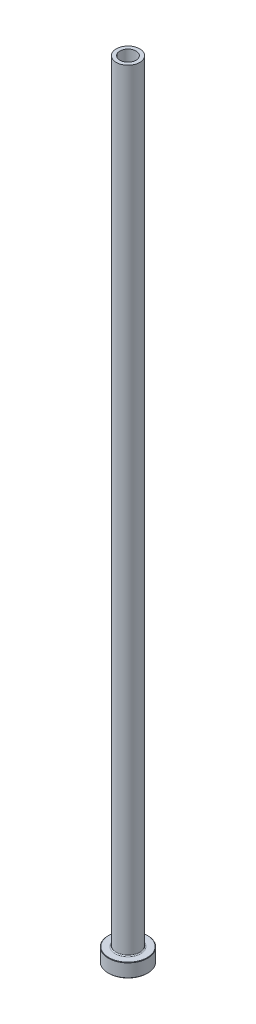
ISO-10303-21;
HEADER;
FILE_DESCRIPTION(('STEP AP214'),'2;1');
FILE_NAME('part.step','',(''),(''),'','','');
FILE_SCHEMA(('AUTOMOTIVE_DESIGN { 1 0 10303 214 1 1 1 1 }'));
ENDSEC;
DATA;
#1=APPLICATION_CONTEXT('core data for automotive mechanical design processes');
#2=APPLICATION_PROTOCOL_DEFINITION('international standard','automotive_design',2000,#1);
#3=PRODUCT_CONTEXT('',#1,'mechanical');
#4=PRODUCT('Part','Part','',(#3));
#5=PRODUCT_RELATED_PRODUCT_CATEGORY('part','',(#4));
#6=PRODUCT_DEFINITION_FORMATION('','',#4);
#7=PRODUCT_DEFINITION_CONTEXT('part definition',#1,'design');
#8=PRODUCT_DEFINITION('design','',#6,#7);
#9=PRODUCT_DEFINITION_SHAPE('','',#8);
#10=(LENGTH_UNIT() NAMED_UNIT(*) SI_UNIT(.MILLI.,.METRE.));
#11=(NAMED_UNIT(*) PLANE_ANGLE_UNIT() SI_UNIT($,.RADIAN.));
#12=(NAMED_UNIT(*) SI_UNIT($,.STERADIAN.) SOLID_ANGLE_UNIT());
#13=UNCERTAINTY_MEASURE_WITH_UNIT(LENGTH_MEASURE(1.E-05),#10,'distance_accuracy_value','');
#14=(GEOMETRIC_REPRESENTATION_CONTEXT(3) GLOBAL_UNCERTAINTY_ASSIGNED_CONTEXT((#13)) GLOBAL_UNIT_ASSIGNED_CONTEXT((#10,
#11,#12)) REPRESENTATION_CONTEXT('',''));
#15=CARTESIAN_POINT('',(0.,0.,0.));
#16=DIRECTION('',(0.,0.,1.));
#17=DIRECTION('',(1.,0.,0.));
#18=AXIS2_PLACEMENT_3D('',#15,#16,#17);
#19=CARTESIAN_POINT('',(0.,92.1876809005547,0.));
#20=DIRECTION('',(0.,1.,0.));
#21=DIRECTION('',(0.,0.,1.));
#22=AXIS2_PLACEMENT_3D('',#19,#20,#21);
#23=CYLINDRICAL_SURFACE('',#22,4.10000000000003);
#24=CARTESIAN_POINT('',(0.,400.,0.));
#25=DIRECTION('',(0.,1.,0.));
#26=DIRECTION('',(0.,0.,1.));
#27=AXIS2_PLACEMENT_3D('',#24,#25,#26);
#28=CIRCLE('',#27,4.10000000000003);
#29=CARTESIAN_POINT('',(0.,400.,4.10000000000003));
#30=VERTEX_POINT('',#29);
#31=EDGE_CURVE('E62',#30,#30,#28,.T.);
#32=ORIENTED_EDGE('',*,*,#31,.T.);
#33=EDGE_LOOP('',(#32));
#34=FACE_BOUND('',#33,.T.);
#35=CARTESIAN_POINT('',(0.,355.,0.));
#36=DIRECTION('',(0.,1.,0.));
#37=DIRECTION('',(0.,0.,1.));
#38=AXIS2_PLACEMENT_3D('',#35,#36,#37);
#39=CIRCLE('',#38,4.10000000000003);
#40=CARTESIAN_POINT('',(0.,355.,4.10000000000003));
#41=VERTEX_POINT('',#40);
#42=EDGE_CURVE('E71',#41,#41,#39,.T.);
#43=ORIENTED_EDGE('',*,*,#42,.F.);
#44=EDGE_LOOP('',(#43));
#45=FACE_BOUND('',#44,.T.);
#46=ADVANCED_FACE('F30',(#34,#45),#23,.F.);
#47=CARTESIAN_POINT('',(-4.10000000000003,400.,0.));
#48=DIRECTION('',(0.,1.,0.));
#49=DIRECTION('',(0.,0.,1.));
#50=AXIS2_PLACEMENT_3D('',#47,#48,#49);
#51=PLANE('',#50);
#52=CARTESIAN_POINT('',(0.,400.,0.));
#53=DIRECTION('',(0.,1.,0.));
#54=DIRECTION('',(0.,0.,1.));
#55=AXIS2_PLACEMENT_3D('',#52,#53,#54);
#56=CIRCLE('',#55,6.00000000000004);
#57=CARTESIAN_POINT('',(0.,400.,6.00000000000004));
#58=VERTEX_POINT('',#57);
#59=EDGE_CURVE('E65',#58,#58,#56,.T.);
#60=ORIENTED_EDGE('',*,*,#59,.T.);
#61=EDGE_LOOP('',(#60));
#62=FACE_BOUND('',#61,.T.);
#63=ORIENTED_EDGE('',*,*,#31,.F.);
#64=EDGE_LOOP('',(#63));
#65=FACE_BOUND('',#64,.T.);
#66=ADVANCED_FACE('F79',(#62,#65),#51,.T.);
#67=CARTESIAN_POINT('',(0.,92.1876809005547,0.));
#68=DIRECTION('',(0.,1.,0.));
#69=DIRECTION('',(0.,0.,1.));
#70=AXIS2_PLACEMENT_3D('',#67,#68,#69);
#71=CYLINDRICAL_SURFACE('',#70,6.00000000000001);
#72=CARTESIAN_POINT('',(0.,7.50000000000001,0.));
#73=DIRECTION('',(0.,1.,0.));
#74=DIRECTION('',(0.,0.,1.));
#75=AXIS2_PLACEMENT_3D('',#72,#73,#74);
#76=CIRCLE('',#75,6.00000000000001);
#77=CARTESIAN_POINT('',(0.,7.50000000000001,6.00000000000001));
#78=VERTEX_POINT('',#77);
#79=EDGE_CURVE('E59',#78,#78,#76,.T.);
#80=ORIENTED_EDGE('',*,*,#79,.T.);
#81=EDGE_LOOP('',(#80));
#82=FACE_BOUND('',#81,.T.);
#83=ORIENTED_EDGE('',*,*,#59,.F.);
#84=EDGE_LOOP('',(#83));
#85=FACE_BOUND('',#84,.T.);
#86=ADVANCED_FACE('F85',(#82,#85),#71,.T.);
#87=CARTESIAN_POINT('',(-5.99999999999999,7.,0.));
#88=DIRECTION('',(0.,1.,0.));
#89=DIRECTION('',(0.,0.,1.));
#90=AXIS2_PLACEMENT_3D('',#87,#88,#89);
#91=PLANE('',#90);
#92=CARTESIAN_POINT('',(0.,7.,0.));
#93=DIRECTION('',(0.,1.,0.));
#94=DIRECTION('',(0.,0.,1.));
#95=AXIS2_PLACEMENT_3D('',#92,#93,#94);
#96=CIRCLE('',#95,9.80000000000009);
#97=CARTESIAN_POINT('',(0.,7.,9.80000000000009));
#98=VERTEX_POINT('',#97);
#99=EDGE_CURVE('E53',#98,#98,#96,.T.);
#100=ORIENTED_EDGE('',*,*,#99,.T.);
#101=EDGE_LOOP('',(#100));
#102=FACE_BOUND('',#101,.T.);
#103=CARTESIAN_POINT('',(0.,7.,0.));
#104=DIRECTION('',(0.,1.,0.));
#105=DIRECTION('',(0.,0.,1.));
#106=AXIS2_PLACEMENT_3D('',#103,#104,#105);
#107=CIRCLE('',#106,6.50000000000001);
#108=CARTESIAN_POINT('',(0.,7.,6.50000000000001));
#109=VERTEX_POINT('',#108);
#110=EDGE_CURVE('E56',#109,#109,#107,.F.);
#111=ORIENTED_EDGE('',*,*,#110,.T.);
#112=EDGE_LOOP('',(#111));
#113=FACE_BOUND('',#112,.T.);
#114=ADVANCED_FACE('F111',(#102,#113),#91,.T.);
#115=CARTESIAN_POINT('',(0.,92.1876809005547,0.));
#116=DIRECTION('',(0.,1.,0.));
#117=DIRECTION('',(0.,0.,1.));
#118=AXIS2_PLACEMENT_3D('',#115,#116,#117);
#119=CYLINDRICAL_SURFACE('',#118,9.99999999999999);
#120=CARTESIAN_POINT('',(0.,6.80000000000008,0.));
#121=DIRECTION('',(0.,1.,0.));
#122=DIRECTION('',(0.,0.,1.));
#123=AXIS2_PLACEMENT_3D('',#120,#121,#122);
#124=CIRCLE('',#123,9.99999999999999);
#125=CARTESIAN_POINT('',(0.,6.80000000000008,9.99999999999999));
#126=VERTEX_POINT('',#125);
#127=EDGE_CURVE('E45',#126,#126,#124,.F.);
#128=CARTESIAN_POINT('',(0.,0.199999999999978,0.));
#129=DIRECTION('',(0.,-1.,0.));
#130=DIRECTION('',(0.,0.,-1.));
#131=AXIS2_PLACEMENT_3D('',#128,#129,#130);
#132=CIRCLE('',#131,9.99999999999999);
#133=CARTESIAN_POINT('',(0.,0.199999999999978,9.99999999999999));
#134=VERTEX_POINT('',#133);
#135=EDGE_CURVE('E50',#134,#134,#132,.F.);
#136=CARTESIAN_POINT('',(0.,6.80000000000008,9.99999999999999));
#137=CARTESIAN_POINT('',(0.,6.73125000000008,9.99999999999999));
#138=CARTESIAN_POINT('',(0.,6.66250000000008,9.99999999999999));
#139=CARTESIAN_POINT('',(0.,6.52500000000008,9.99999999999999));
#140=CARTESIAN_POINT('',(0.,6.45625000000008,9.99999999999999));
#141=CARTESIAN_POINT('',(0.,6.31875000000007,9.99999999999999));
#142=CARTESIAN_POINT('',(0.,6.25000000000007,9.99999999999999));
#143=CARTESIAN_POINT('',(0.,6.11250000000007,9.99999999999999));
#144=CARTESIAN_POINT('',(0.,6.04375000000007,9.99999999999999));
#145=CARTESIAN_POINT('',(0.,5.90625000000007,9.99999999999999));
#146=CARTESIAN_POINT('',(0.,5.83750000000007,9.99999999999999));
#147=CARTESIAN_POINT('',(0.,5.70000000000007,9.99999999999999));
#148=CARTESIAN_POINT('',(0.,5.63125000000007,9.99999999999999));
#149=CARTESIAN_POINT('',(0.,5.49375000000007,9.99999999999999));
#150=CARTESIAN_POINT('',(0.,5.42500000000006,9.99999999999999));
#151=CARTESIAN_POINT('',(0.,5.28750000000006,9.99999999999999));
#152=CARTESIAN_POINT('',(0.,5.21875000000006,9.99999999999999));
#153=CARTESIAN_POINT('',(0.,5.08125000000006,9.99999999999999));
#154=CARTESIAN_POINT('',(0.,5.01250000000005,9.99999999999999));
#155=CARTESIAN_POINT('',(0.,4.87500000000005,9.99999999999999));
#156=CARTESIAN_POINT('',(0.,4.80625000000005,9.99999999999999));
#157=CARTESIAN_POINT('',(0.,4.66875000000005,9.99999999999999));
#158=CARTESIAN_POINT('',(0.,4.60000000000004,9.99999999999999));
#159=CARTESIAN_POINT('',(0.,4.46250000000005,9.99999999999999));
#160=CARTESIAN_POINT('',(0.,4.39375000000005,9.99999999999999));
#161=CARTESIAN_POINT('',(0.,4.25625000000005,9.99999999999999));
#162=CARTESIAN_POINT('',(0.,4.18750000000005,9.99999999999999));
#163=CARTESIAN_POINT('',(0.,4.05000000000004,9.99999999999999));
#164=CARTESIAN_POINT('',(0.,3.98125000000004,9.99999999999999));
#165=CARTESIAN_POINT('',(0.,3.84375000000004,9.99999999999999));
#166=CARTESIAN_POINT('',(0.,3.77500000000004,9.99999999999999));
#167=CARTESIAN_POINT('',(0.,3.63750000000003,9.99999999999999));
#168=CARTESIAN_POINT('',(0.,3.56875000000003,9.99999999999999));
#169=CARTESIAN_POINT('',(0.,3.43125000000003,9.99999999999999));
#170=CARTESIAN_POINT('',(0.,3.36250000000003,9.99999999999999));
#171=CARTESIAN_POINT('',(0.,3.22500000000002,9.99999999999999));
#172=CARTESIAN_POINT('',(0.,3.15625000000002,9.99999999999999));
#173=CARTESIAN_POINT('',(0.,3.01875000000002,9.99999999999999));
#174=CARTESIAN_POINT('',(0.,2.95000000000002,9.99999999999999));
#175=CARTESIAN_POINT('',(0.,2.81250000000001,9.99999999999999));
#176=CARTESIAN_POINT('',(0.,2.74375000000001,9.99999999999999));
#177=CARTESIAN_POINT('',(0.,2.60625000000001,9.99999999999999));
#178=CARTESIAN_POINT('',(0.,2.53750000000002,9.99999999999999));
#179=CARTESIAN_POINT('',(0.,2.40000000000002,9.99999999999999));
#180=CARTESIAN_POINT('',(0.,2.33125000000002,9.99999999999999));
#181=CARTESIAN_POINT('',(0.,2.19375000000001,9.99999999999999));
#182=CARTESIAN_POINT('',(0.,2.12500000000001,9.99999999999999));
#183=CARTESIAN_POINT('',(0.,1.98750000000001,9.99999999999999));
#184=CARTESIAN_POINT('',(0.,1.91875000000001,9.99999999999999));
#185=CARTESIAN_POINT('',(0.,1.78125,9.99999999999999));
#186=CARTESIAN_POINT('',(0.,1.7125,9.99999999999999));
#187=CARTESIAN_POINT('',(0.,1.575,9.99999999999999));
#188=CARTESIAN_POINT('',(0.,1.50625,9.99999999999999));
#189=CARTESIAN_POINT('',(0.,1.36874999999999,9.99999999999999));
#190=CARTESIAN_POINT('',(0.,1.29999999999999,9.99999999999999));
#191=CARTESIAN_POINT('',(0.,1.16249999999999,9.99999999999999));
#192=CARTESIAN_POINT('',(0.,1.09375,9.99999999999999));
#193=CARTESIAN_POINT('',(0.,0.956249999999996,9.99999999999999));
#194=CARTESIAN_POINT('',(0.,0.887499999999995,9.99999999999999));
#195=CARTESIAN_POINT('',(0.,0.749999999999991,9.99999999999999));
#196=CARTESIAN_POINT('',(0.,0.68124999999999,9.99999999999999));
#197=CARTESIAN_POINT('',(0.,0.543749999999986,9.99999999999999));
#198=CARTESIAN_POINT('',(0.,0.474999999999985,9.99999999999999));
#199=CARTESIAN_POINT('',(0.,0.337499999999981,9.99999999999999));
#200=CARTESIAN_POINT('',(0.,0.26874999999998,9.99999999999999));
#201=CARTESIAN_POINT('',(0.,0.199999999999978,9.99999999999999));
#202=B_SPLINE_CURVE_WITH_KNOTS('',3,(#136,#137,#138,#139,#140,#141,#142,#143,#144,#145,#146,
#147,#148,#149,#150,#151,#152,#153,#154,#155,#156,#157,#158,#159,#160,#161,#162,#163,#164,#165,
#166,#167,#168,#169,#170,#171,#172,#173,#174,#175,#176,#177,#178,#179,#180,#181,#182,#183,#184,
#185,#186,#187,#188,#189,#190,#191,#192,#193,#194,#195,#196,#197,#198,#199,#200,#201),
.UNSPECIFIED.,.F.,.F.,(4,2,2,2,2,2,2,2,2,2,2,2,2,2,2,2,2,2,2,2,2,2,2,2,2,2,2,2,2,2,2,2,4),(0.,
0.206250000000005,0.41250000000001,0.618750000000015,0.82500000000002,1.03125000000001,
1.23750000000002,1.44375000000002,1.65000000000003,1.85625000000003,2.06250000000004,
2.26875000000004,2.47500000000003,2.68125000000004,2.88750000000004,3.09375000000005,
3.30000000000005,3.50625000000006,3.71250000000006,3.91875000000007,4.12500000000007,
4.33125000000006,4.53750000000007,4.74375000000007,4.95000000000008,5.15625000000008,
5.36250000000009,5.56875000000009,5.77500000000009,5.98125000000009,6.1875000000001,
6.3937500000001,6.60000000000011),.UNSPECIFIED.);
#203=EDGE_CURVE('BSEAM108',#126,#134,#202,.T.);
#204=ORIENTED_EDGE('',*,*,#127,.T.);
#205=ORIENTED_EDGE('',*,*,#135,.T.);
#206=ORIENTED_EDGE('',*,*,#203,.T.);
#207=ORIENTED_EDGE('',*,*,#203,.F.);
#208=EDGE_LOOP('',(#204,#206,#205,#207));
#209=FACE_BOUND('',#208,.T.);
#210=ADVANCED_FACE('F108',(#209),#119,.T.);
#211=CARTESIAN_POINT('',(-9.99999999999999,0.,0.));
#212=DIRECTION('',(0.,-1.,0.));
#213=DIRECTION('',(0.,0.,-1.));
#214=AXIS2_PLACEMENT_3D('',#211,#212,#213);
#215=PLANE('',#214);
#216=CARTESIAN_POINT('',(0.,0.,0.));
#217=DIRECTION('',(0.,-1.,0.));
#218=DIRECTION('',(0.,0.,-1.));
#219=AXIS2_PLACEMENT_3D('',#216,#217,#218);
#220=CIRCLE('',#219,4.84999999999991);
#221=CARTESIAN_POINT('',(0.,0.,-4.84999999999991));
#222=VERTEX_POINT('',#221);
#223=EDGE_CURVE('E37',#222,#222,#220,.F.);
#224=ORIENTED_EDGE('',*,*,#223,.T.);
#225=EDGE_LOOP('',(#224));
#226=FACE_BOUND('',#225,.T.);
#227=CARTESIAN_POINT('',(0.,0.,0.));
#228=DIRECTION('',(0.,-1.,0.));
#229=DIRECTION('',(0.,0.,-1.));
#230=AXIS2_PLACEMENT_3D('',#227,#228,#229);
#231=CIRCLE('',#230,9.80000000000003);
#232=CARTESIAN_POINT('',(0.,0.,9.80000000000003));
#233=VERTEX_POINT('',#232);
#234=EDGE_CURVE('E41',#233,#233,#231,.T.);
#235=ORIENTED_EDGE('',*,*,#234,.T.);
#236=EDGE_LOOP('',(#235));
#237=FACE_BOUND('',#236,.T.);
#238=ADVANCED_FACE('F110',(#226,#237),#215,.T.);
#239=CARTESIAN_POINT('',(0.,92.1876809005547,0.));
#240=DIRECTION('',(0.,1.,0.));
#241=DIRECTION('',(0.,0.,1.));
#242=AXIS2_PLACEMENT_3D('',#239,#240,#241);
#243=CYLINDRICAL_SURFACE('',#242,4.35000000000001);
#244=CARTESIAN_POINT('',(0.,0.499999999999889,0.));
#245=DIRECTION('',(0.,-1.,0.));
#246=DIRECTION('',(0.,0.,-1.));
#247=AXIS2_PLACEMENT_3D('',#244,#245,#246);
#248=CIRCLE('',#247,4.35000000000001);
#249=CARTESIAN_POINT('',(0.,0.499999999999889,-4.35000000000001));
#250=VERTEX_POINT('',#249);
#251=EDGE_CURVE('E10',#250,#250,#248,.T.);
#252=ORIENTED_EDGE('',*,*,#251,.T.);
#253=EDGE_LOOP('',(#252));
#254=FACE_BOUND('',#253,.T.);
#255=CARTESIAN_POINT('',(0.,343.,0.));
#256=DIRECTION('',(0.,1.,0.));
#257=DIRECTION('',(0.,0.,1.));
#258=AXIS2_PLACEMENT_3D('',#255,#256,#257);
#259=CIRCLE('',#258,4.35000000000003);
#260=CARTESIAN_POINT('',(0.,343.,4.35000000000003));
#261=VERTEX_POINT('',#260);
#262=EDGE_CURVE('E68',#261,#261,#259,.T.);
#263=ORIENTED_EDGE('',*,*,#262,.T.);
#264=EDGE_LOOP('',(#263));
#265=FACE_BOUND('',#264,.T.);
#266=ADVANCED_FACE('F118',(#254,#265),#243,.F.);
#267=CARTESIAN_POINT('',(0.,343.,0.));
#268=DIRECTION('',(0.,-1.,0.));
#269=DIRECTION('',(0.,0.,-1.));
#270=AXIS2_PLACEMENT_3D('',#267,#268,#269);
#271=CONICAL_SURFACE('',#270,4.35000000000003,0.0208303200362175);
#272=ORIENTED_EDGE('',*,*,#42,.T.);
#273=EDGE_LOOP('',(#272));
#274=FACE_BOUND('',#273,.T.);
#275=ORIENTED_EDGE('',*,*,#262,.F.);
#276=EDGE_LOOP('',(#275));
#277=FACE_BOUND('',#276,.T.);
#278=ADVANCED_FACE('F75',(#274,#277),#271,.F.);
#279=CARTESIAN_POINT('',(0.,7.50000000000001,0.));
#280=DIRECTION('',(0.,1.,0.));
#281=DIRECTION('',(0.,0.,1.));
#282=AXIS2_PLACEMENT_3D('',#279,#280,#281);
#283=TOROIDAL_SURFACE('',#282,6.50000000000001,0.5);
#284=ORIENTED_EDGE('',*,*,#110,.F.);
#285=EDGE_LOOP('',(#284));
#286=FACE_BOUND('',#285,.T.);
#287=ORIENTED_EDGE('',*,*,#79,.F.);
#288=EDGE_LOOP('',(#287));
#289=FACE_BOUND('',#288,.T.);
#290=ADVANCED_FACE('F90',(#286,#289),#283,.F.);
#291=CARTESIAN_POINT('',(0.,7.00000000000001,0.));
#292=DIRECTION('',(0.,-1.,0.));
#293=DIRECTION('',(0.,0.,-1.));
#294=AXIS2_PLACEMENT_3D('',#291,#292,#293);
#295=CONICAL_SURFACE('',#294,9.80000000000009,0.785398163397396);
#296=ORIENTED_EDGE('',*,*,#127,.F.);
#297=EDGE_LOOP('',(#296));
#298=FACE_BOUND('',#297,.T.);
#299=ORIENTED_EDGE('',*,*,#99,.F.);
#300=EDGE_LOOP('',(#299));
#301=FACE_BOUND('',#300,.T.);
#302=ADVANCED_FACE('F93',(#298,#301),#295,.T.);
#303=CARTESIAN_POINT('',(0.,0.199999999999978,0.));
#304=DIRECTION('',(0.,1.,0.));
#305=DIRECTION('',(0.,0.,1.));
#306=AXIS2_PLACEMENT_3D('',#303,#304,#305);
#307=CONICAL_SURFACE('',#306,9.99999999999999,0.785398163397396);
#308=CARTESIAN_POINT('',(0.,0.,9.80000000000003));
#309=CARTESIAN_POINT('',(0.,0.00208333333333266,9.80208333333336));
#310=CARTESIAN_POINT('',(0.,0.00416666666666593,9.8041666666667));
#311=CARTESIAN_POINT('',(0.,0.00833333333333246,9.80833333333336));
#312=CARTESIAN_POINT('',(0.,0.0104166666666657,9.8104166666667));
#313=CARTESIAN_POINT('',(0.,0.0145833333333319,9.81458333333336));
#314=CARTESIAN_POINT('',(0.,0.0166666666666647,9.81666666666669));
#315=CARTESIAN_POINT('',(0.,0.0208333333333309,9.82083333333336));
#316=CARTESIAN_POINT('',(0.,0.0229166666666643,9.82291666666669));
#317=CARTESIAN_POINT('',(0.,0.0270833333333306,9.82708333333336));
#318=CARTESIAN_POINT('',(0.,0.0291666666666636,9.82916666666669));
#319=CARTESIAN_POINT('',(0.,0.0333333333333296,9.83333333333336));
#320=CARTESIAN_POINT('',(0.,0.0354166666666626,9.83541666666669));
#321=CARTESIAN_POINT('',(0.,0.0395833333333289,9.83958333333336));
#322=CARTESIAN_POINT('',(0.,0.0416666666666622,9.84166666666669));
#323=CARTESIAN_POINT('',(0.,0.0458333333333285,9.84583333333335));
#324=CARTESIAN_POINT('',(0.,0.0479166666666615,9.84791666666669));
#325=CARTESIAN_POINT('',(0.,0.0520833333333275,9.85208333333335));
#326=CARTESIAN_POINT('',(0.,0.0541666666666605,9.85416666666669));
#327=CARTESIAN_POINT('',(0.,0.0583333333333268,9.85833333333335));
#328=CARTESIAN_POINT('',(0.,0.0604166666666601,9.86041666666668));
#329=CARTESIAN_POINT('',(0.,0.0645833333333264,9.86458333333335));
#330=CARTESIAN_POINT('',(0.,0.0666666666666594,9.86666666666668));
#331=CARTESIAN_POINT('',(0.,0.0708333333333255,9.87083333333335));
#332=CARTESIAN_POINT('',(0.,0.0729166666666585,9.87291666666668));
#333=CARTESIAN_POINT('',(0.,0.0770833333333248,9.87708333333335));
#334=CARTESIAN_POINT('',(0.,0.0791666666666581,9.87916666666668));
#335=CARTESIAN_POINT('',(0.,0.0833333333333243,9.88333333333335));
#336=CARTESIAN_POINT('',(0.,0.0854166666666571,9.88541666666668));
#337=CARTESIAN_POINT('',(0.,0.0895833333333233,9.88958333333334));
#338=CARTESIAN_POINT('',(0.,0.0916666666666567,9.89166666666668));
#339=CARTESIAN_POINT('',(0.,0.095833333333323,9.89583333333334));
#340=CARTESIAN_POINT('',(0.,0.097916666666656,9.89791666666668));
#341=CARTESIAN_POINT('',(0.,0.102083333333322,9.90208333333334));
#342=CARTESIAN_POINT('',(0.,0.104166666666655,9.90416666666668));
#343=CARTESIAN_POINT('',(0.,0.108333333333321,9.90833333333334));
#344=CARTESIAN_POINT('',(0.,0.110416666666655,9.91041666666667));
#345=CARTESIAN_POINT('',(0.,0.114583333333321,9.91458333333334));
#346=CARTESIAN_POINT('',(0.,0.116666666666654,9.91666666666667));
#347=CARTESIAN_POINT('',(0.,0.12083333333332,9.92083333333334));
#348=CARTESIAN_POINT('',(0.,0.122916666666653,9.92291666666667));
#349=CARTESIAN_POINT('',(0.,0.127083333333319,9.92708333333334));
#350=CARTESIAN_POINT('',(0.,0.129166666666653,9.92916666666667));
#351=CARTESIAN_POINT('',(0.,0.133333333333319,9.93333333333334));
#352=CARTESIAN_POINT('',(0.,0.135416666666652,9.93541666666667));
#353=CARTESIAN_POINT('',(0.,0.139583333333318,9.93958333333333));
#354=CARTESIAN_POINT('',(0.,0.141666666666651,9.94166666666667));
#355=CARTESIAN_POINT('',(0.,0.145833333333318,9.94583333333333));
#356=CARTESIAN_POINT('',(0.,0.147916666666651,9.94791666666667));
#357=CARTESIAN_POINT('',(0.,0.152083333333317,9.95208333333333));
#358=CARTESIAN_POINT('',(0.,0.15416666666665,9.95416666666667));
#359=CARTESIAN_POINT('',(0.,0.158333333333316,9.95833333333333));
#360=CARTESIAN_POINT('',(0.,0.160416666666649,9.96041666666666));
#361=CARTESIAN_POINT('',(0.,0.164583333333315,9.96458333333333));
#362=CARTESIAN_POINT('',(0.,0.166666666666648,9.96666666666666));
#363=CARTESIAN_POINT('',(0.,0.170833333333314,9.97083333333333));
#364=CARTESIAN_POINT('',(0.,0.172916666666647,9.97291666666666));
#365=CARTESIAN_POINT('',(0.,0.177083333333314,9.97708333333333));
#366=CARTESIAN_POINT('',(0.,0.179166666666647,9.97916666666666));
#367=CARTESIAN_POINT('',(0.,0.183333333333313,9.98333333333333));
#368=CARTESIAN_POINT('',(0.,0.185416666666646,9.98541666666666));
#369=CARTESIAN_POINT('',(0.,0.189583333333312,9.98958333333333));
#370=CARTESIAN_POINT('',(0.,0.191666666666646,9.99166666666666));
#371=CARTESIAN_POINT('',(0.,0.195833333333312,9.99583333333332));
#372=CARTESIAN_POINT('',(0.,0.197916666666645,9.99791666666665));
#373=CARTESIAN_POINT('',(0.,0.199999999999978,9.99999999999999));
#374=B_SPLINE_CURVE_WITH_KNOTS('',3,(#308,#309,#310,#311,#312,#313,#314,#315,#316,#317,#318,
#319,#320,#321,#322,#323,#324,#325,#326,#327,#328,#329,#330,#331,#332,#333,#334,#335,#336,#337,
#338,#339,#340,#341,#342,#343,#344,#345,#346,#347,#348,#349,#350,#351,#352,#353,#354,#355,#356,
#357,#358,#359,#360,#361,#362,#363,#364,#365,#366,#367,#368,#369,#370,#371,#372,#373),
.UNSPECIFIED.,.F.,.F.,(4,2,2,2,2,2,2,2,2,2,2,2,2,2,2,2,2,2,2,2,2,2,2,2,2,2,2,2,2,2,2,2,4),(0.,
0.00883883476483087,0.0176776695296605,0.0265165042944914,0.035355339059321,0.0441941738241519,
0.0530330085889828,0.0618718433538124,0.0707106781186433,0.0795495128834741,0.0883883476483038,
0.0972271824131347,0.106066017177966,0.114904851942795,0.123743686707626,0.132582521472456,
0.141421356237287,0.150260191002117,0.159099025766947,0.167937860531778,0.176776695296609,
0.185615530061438,0.194454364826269,0.203293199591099,0.21213203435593,0.220970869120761,
0.22980970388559,0.238648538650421,0.247487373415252,0.256326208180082,0.265165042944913,
0.274003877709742,0.282842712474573),.UNSPECIFIED.);
#375=EDGE_CURVE('BSEAM96',#233,#134,#374,.T.);
#376=ORIENTED_EDGE('',*,*,#234,.F.);
#377=ORIENTED_EDGE('',*,*,#135,.F.);
#378=ORIENTED_EDGE('',*,*,#375,.T.);
#379=ORIENTED_EDGE('',*,*,#375,.F.);
#380=EDGE_LOOP('',(#376,#378,#377,#379));
#381=FACE_BOUND('',#380,.T.);
#382=ADVANCED_FACE('F96',(#381),#307,.T.);
#383=CARTESIAN_POINT('',(0.,0.,0.));
#384=DIRECTION('',(0.,-1.,0.));
#385=DIRECTION('',(0.,0.,-1.));
#386=AXIS2_PLACEMENT_3D('',#383,#384,#385);
#387=CONICAL_SURFACE('',#386,4.84999999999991,0.785398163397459);
#388=ORIENTED_EDGE('',*,*,#251,.F.);
#389=EDGE_LOOP('',(#388));
#390=FACE_BOUND('',#389,.T.);
#391=ORIENTED_EDGE('',*,*,#223,.F.);
#392=EDGE_LOOP('',(#391));
#393=FACE_BOUND('',#392,.T.);
#394=ADVANCED_FACE('F32',(#390,#393),#387,.F.);
#395=CLOSED_SHELL('',(#46,#66,#86,#114,#210,#238,#266,#278,#290,#302,#382,#394));
#396=MANIFOLD_SOLID_BREP('B2',#395);
#397=ADVANCED_BREP_SHAPE_REPRESENTATION('',(#18,#396),#14);
#398=SHAPE_DEFINITION_REPRESENTATION(#9,#397);
ENDSEC;
END-ISO-10303-21;
